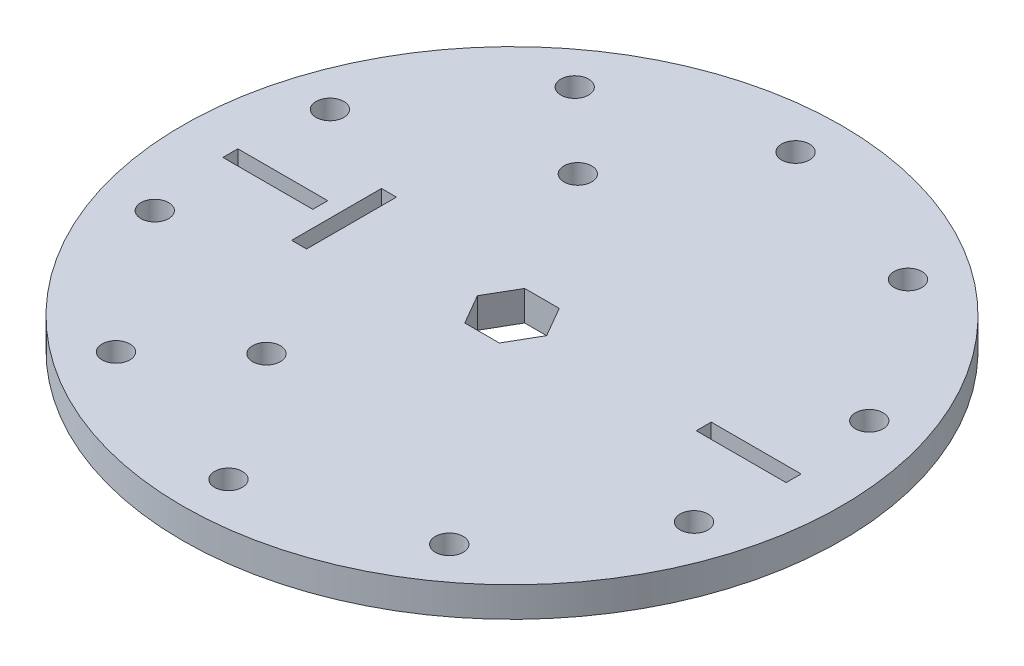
from build123d import *

# Parameters (mm, degrees)
SKETCH1_R             = 34.925
BOSS_EXTRUDE1_DEPTH   = 3.175
F_4_CLEARANCE_HOLE1_D = 2.9464
F_4_CLEARANCE_HOLE4_D = 2.9464
SKETCH5_W             = 9.525
SKETCH5_H             = 1.5875
CUT_EXTRUDE1_DEPTH    = 50.493351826
SKETCH10_W            = 1.5875
SKETCH10_H            = 9.525
CUT_EXTRUDE2_DEPTH    = 50.493351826


with BuildPart() as part:
    # Sketch1 → Boss-Extrude1 (new body)
    with BuildSketch(Plane(origin=(0, 0, 0), x_dir=(1, 0, 0), z_dir=(0, 1, 0))):
        with Locations(Location((0, 0, 0), (0, 0, 270))):
            Circle(SKETCH1_R)
        Polygon((1.833087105, 3.175), (-1.833087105, 3.175), (-3.666174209, 0), (-1.833087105, -3.175), (1.833087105, -3.175), (3.666174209, 0), align=None, mode=Mode.SUBTRACT)
    extrude(amount=BOSS_EXTRUDE1_DEPTH)

    # 4 Clearance Hole1 (through all)
    with Locations(Plane(origin=(0, 3.175, 0), x_dir=(1, 0, 0), z_dir=(0, 1, 0))):
        with Locations((0, 30.045533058), (-17.660321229, 24.307346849), (-28.575, 9.28458032), (-28.575, -9.28458032), (-17.660321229, -24.307346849), (0, -30.045533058), (17.660321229, -24.307346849), (28.575, -9.28458032), (28.575, 9.28458032), (17.660321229, 24.307346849)):
            Hole(F_4_CLEARANCE_HOLE1_D / 2)

    # 4 Clearance Hole4 (through all)
    with Locations(Plane(origin=(0, 3.175, 0), x_dir=(1, 0, 0), z_dir=(0, 1, 0))):
        with Locations((-9.525, 16.497783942), (-9.525, -16.497783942)):
            Hole(F_4_CLEARANCE_HOLE4_D / 2)

    # Sketch5 → Cut-Extrude1 (cut, through all)
    with BuildSketch(Plane(origin=(0, 3.175, 0), x_dir=(1, 0, 0), z_dir=(0, 1, 0))):
        with Locations((-25.0825, 0)):
            Rectangle(SKETCH5_W, SKETCH5_H)
        with Locations((25.0825, 0)):
            Rectangle(SKETCH5_W, SKETCH5_H)
    extrude(amount=-CUT_EXTRUDE1_DEPTH, mode=Mode.SUBTRACT)

    # Sketch10 → Cut-Extrude2 (cut, through all)
    with BuildSketch(Plane(origin=(0, 3.175, 0), x_dir=(1, 0, 0), z_dir=(0, 1, 0))):
        with Locations((-17.800060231, 0)):
            Rectangle(SKETCH10_W, SKETCH10_H)
    extrude(amount=-CUT_EXTRUDE2_DEPTH, mode=Mode.SUBTRACT)


solid = part.part
